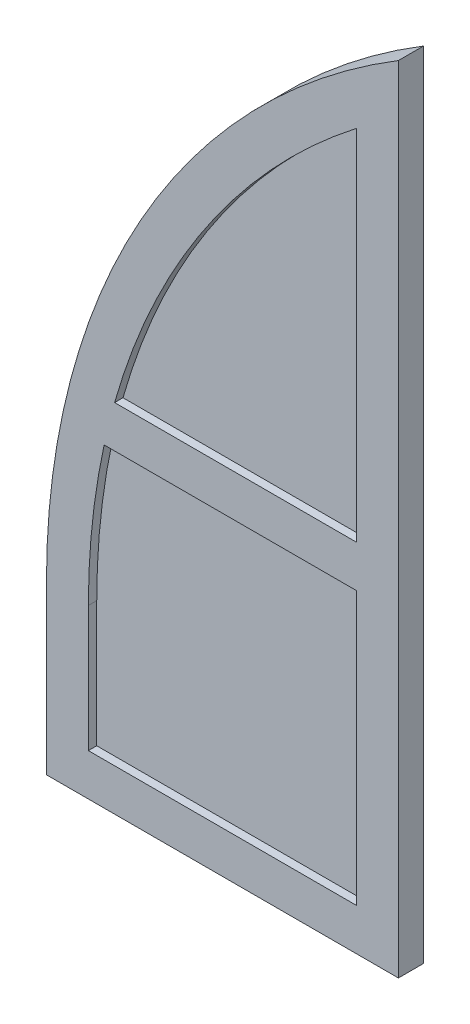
from build123d import *

# Parameters (mm, degrees)
SALIENTE_EXTRUIR2_DEPTH   = 40
SALIENTE_EXTRUIR2_2_DEPTH = 40
SALIENTE_EXTRUIR3_DEPTH   = 60
CORTAR_EXTRUIR1_DEPTH     = 10
SALIENTE_EXTRUIR4_DEPTH   = 10


with BuildPart() as part:
    # Croquis1 → Saliente-Extruir2 (new body)
    with BuildSketch(Plane.XY):
        with BuildLine():
            ThreePointArc((-241.815699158, -151.128411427), (-21.615845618, 322.841669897), (335.544883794, 704.380431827))
            Line((335.544883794, 704.380431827), (335.544883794, -151.128411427))
            Line((335.544883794, -151.128411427), (-241.815699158, -151.128411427))
        make_face()
    extrude(amount=SALIENTE_EXTRUIR2_DEPTH)



with BuildPart() as body_2:
    # Croquis1 → Saliente-Extruir2 2 (new body)
    with BuildSketch(Plane.XY):
        with BuildLine():
            ThreePointArc((-304.455116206, -601.868682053), (-295.018574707, -425.491679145), (-266.816689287, -251.128411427))
            Line((-266.816689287, -251.128411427), (335.544883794, -251.128411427))
            Line((335.544883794, -251.128411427), (335.544883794, -901.868682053))
            Line((335.544883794, -901.868682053), (-304.455116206, -901.868682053))
            Line((-304.455116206, -901.868682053), (-304.455116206, -601.868682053))
        make_face()
    extrude(amount=SALIENTE_EXTRUIR2_2_DEPTH)


with BuildPart() as part_1:
    add(part.part)

    add(body_2.part)  # Saliente-Extruir3 merges body 2
    # Croquis1_4 → Saliente-Extruir3 (add)
    with BuildSketch(Plane.XY):
        with BuildLine():
            ThreePointArc((-404.455116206, -601.868682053), (-180.09832136, 256.196198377), (435.544883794, 894.627678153))
            Line((435.544883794, 894.627678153), (435.544883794, -1001.868682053))
            Line((435.544883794, -1001.868682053), (-404.455116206, -1001.868682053))
            Line((-404.455116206, -1001.868682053), (-404.455116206, -601.868682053))
        make_face()
        with BuildLine():
            Line((-304.455116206, -901.868682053), (-304.455116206, -601.868682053))
            ThreePointArc((-304.455116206, -601.868682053), (-295.018574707, -425.491679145), (-266.816689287, -251.128411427))
            Line((-266.816689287, -251.128411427), (335.544883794, -251.128411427))
            Line((335.544883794, -251.128411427), (335.544883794, -901.868682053))
            Line((335.544883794, -901.868682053), (-304.455116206, -901.868682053))
        make_face(mode=Mode.SUBTRACT)
        with BuildLine():
            Line((335.544883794, -151.128411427), (-241.815699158, -151.128411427))
            ThreePointArc((-241.815699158, -151.128411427), (-21.615845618, 322.841669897), (335.544883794, 704.380431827))
            Line((335.544883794, 704.380431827), (335.544883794, -151.128411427))
        make_face(mode=Mode.SUBTRACT)
    extrude(amount=SALIENTE_EXTRUIR3_DEPTH)

    # Croquis2 → Cortar-Extruir1 (cut)
    with BuildSketch(Plane(origin=(0, 0, 0), x_dir=(-1, 0, 0), z_dir=(0, 0, -1))):
        with BuildLine():
            Line((-335.544883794, 704.380431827), (-335.544883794, -901.868682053))
            Line((-335.544883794, -901.868682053), (304.455116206, -901.868682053))
            Line((304.455116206, -901.868682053), (304.455116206, -601.868682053))
            ThreePointArc((304.455116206, -601.868682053), (135.857227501, 125.435715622), (-335.544883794, 704.380431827))
        make_face()
    extrude(amount=-CORTAR_EXTRUIR1_DEPTH, mode=Mode.SUBTRACT)

    # Croquis3 → Saliente-Extruir4 (add)
    with BuildSketch(Plane(origin=(0, 0, 10), x_dir=(-1, 0, 0), z_dir=(0, 0, -1))):
        Polygon((-335.544883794, -145.604084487), (263.72729028, -145.604084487), (293.148375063, -245.604084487), (-335.544883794, -245.604084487), align=None)
    extrude(amount=SALIENTE_EXTRUIR4_DEPTH)


solid = part_1.part
